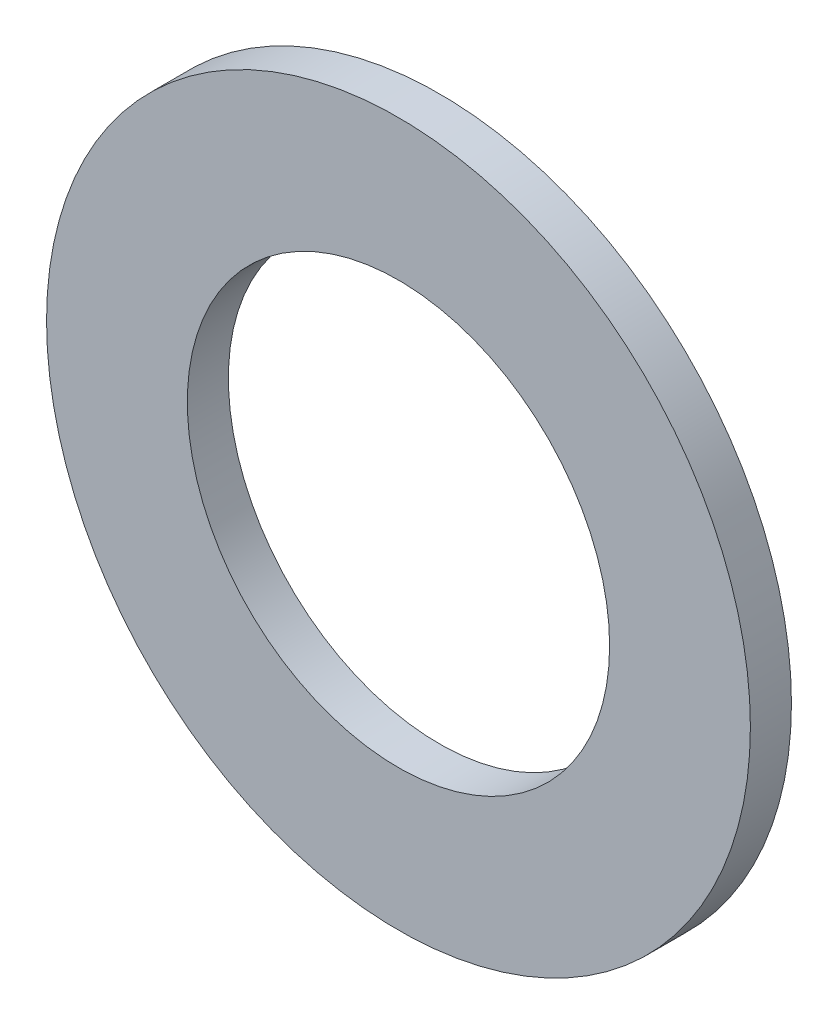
from build123d import *

# Parameters (mm, degrees)
ESQUISSE1_R          = 6
ESQUISSE1_R_2        = 3.6
BASE_EXTRUSION_DEPTH = 0.35


with BuildPart() as part:
    # Esquisse1 → Base-Extrusion (new, symmetric)
    with BuildSketch(Plane.XY):
        Circle(ESQUISSE1_R)
        Circle(ESQUISSE1_R_2, mode=Mode.SUBTRACT)
    extrude(amount=BASE_EXTRUSION_DEPTH, both=True)


solid = part.part
